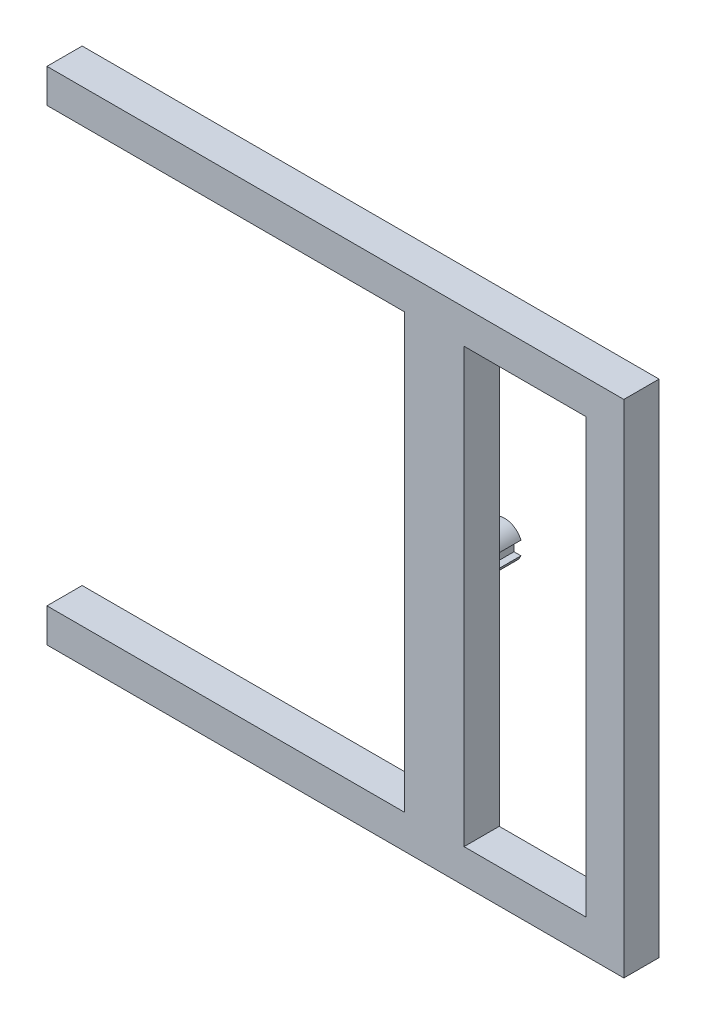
ISO-10303-21;
HEADER;
FILE_DESCRIPTION(('STEP AP214'),'2;1');
FILE_NAME('part.step','',(''),(''),'','','');
FILE_SCHEMA(('AUTOMOTIVE_DESIGN { 1 0 10303 214 1 1 1 1 }'));
ENDSEC;
DATA;
#1=APPLICATION_CONTEXT('core data for automotive mechanical design processes');
#2=APPLICATION_PROTOCOL_DEFINITION('international standard','automotive_design',2000,#1);
#3=PRODUCT_CONTEXT('',#1,'mechanical');
#4=PRODUCT('Part','Part','',(#3));
#5=PRODUCT_RELATED_PRODUCT_CATEGORY('part','',(#4));
#6=PRODUCT_DEFINITION_FORMATION('','',#4);
#7=PRODUCT_DEFINITION_CONTEXT('part definition',#1,'design');
#8=PRODUCT_DEFINITION('design','',#6,#7);
#9=PRODUCT_DEFINITION_SHAPE('','',#8);
#10=(LENGTH_UNIT() NAMED_UNIT(*) SI_UNIT(.MILLI.,.METRE.));
#11=(NAMED_UNIT(*) PLANE_ANGLE_UNIT() SI_UNIT($,.RADIAN.));
#12=(NAMED_UNIT(*) SI_UNIT($,.STERADIAN.) SOLID_ANGLE_UNIT());
#13=UNCERTAINTY_MEASURE_WITH_UNIT(LENGTH_MEASURE(1.E-05),#10,'distance_accuracy_value','');
#14=(GEOMETRIC_REPRESENTATION_CONTEXT(3) GLOBAL_UNCERTAINTY_ASSIGNED_CONTEXT((#13)) GLOBAL_UNIT_ASSIGNED_CONTEXT((#10,
#11,#12)) REPRESENTATION_CONTEXT('',''));
#15=CARTESIAN_POINT('',(0.,0.,0.));
#16=DIRECTION('',(0.,0.,1.));
#17=DIRECTION('',(1.,0.,0.));
#18=AXIS2_PLACEMENT_3D('',#15,#16,#17);
#19=CARTESIAN_POINT('',(0.,25.,0.));
#20=DIRECTION('',(0.,0.,-1.));
#21=DIRECTION('',(-1.,0.,0.));
#22=AXIS2_PLACEMENT_3D('',#19,#20,#21);
#23=PLANE('',#22);
#24=DIRECTION('',(0.,-1.,0.));
#25=VECTOR('',#24,1.);
#26=CARTESIAN_POINT('',(308.,0.,0.));
#27=LINE('',#26,#25);
#28=CARTESIAN_POINT('',(308.,0.,0.));
#29=VERTEX_POINT('',#28);
#30=CARTESIAN_POINT('',(308.,-320.,0.));
#31=VERTEX_POINT('',#30);
#32=EDGE_CURVE('E270',#29,#31,#27,.T.);
#33=ORIENTED_EDGE('',*,*,#32,.T.);
#34=DIRECTION('',(1.,0.,0.));
#35=VECTOR('',#34,1.);
#36=CARTESIAN_POINT('',(398.,-320.,0.));
#37=LINE('',#36,#35);
#38=CARTESIAN_POINT('',(398.,-320.,0.));
#39=VERTEX_POINT('',#38);
#40=EDGE_CURVE('E149',#31,#39,#37,.T.);
#41=ORIENTED_EDGE('',*,*,#40,.T.);
#42=DIRECTION('',(0.,1.,0.));
#43=VECTOR('',#42,1.);
#44=CARTESIAN_POINT('',(398.,0.,0.));
#45=LINE('',#44,#43);
#46=CARTESIAN_POINT('',(398.,0.,0.));
#47=VERTEX_POINT('',#46);
#48=EDGE_CURVE('E262',#39,#47,#45,.T.);
#49=ORIENTED_EDGE('',*,*,#48,.T.);
#50=DIRECTION('',(-1.,0.,0.));
#51=VECTOR('',#50,1.);
#52=CARTESIAN_POINT('',(308.,0.,0.));
#53=LINE('',#52,#51);
#54=EDGE_CURVE('E279',#47,#29,#53,.T.);
#55=ORIENTED_EDGE('',*,*,#54,.T.);
#56=EDGE_LOOP('',(#33,#41,#49,#55));
#57=FACE_BOUND('',#56,.T.);
#58=DIRECTION('',(0.,-1.,0.));
#59=VECTOR('',#58,1.);
#60=CARTESIAN_POINT('',(0.,0.,0.));
#61=LINE('',#60,#59);
#62=CARTESIAN_POINT('',(0.,25.,0.));
#63=VERTEX_POINT('',#62);
#64=CARTESIAN_POINT('',(0.,0.,0.));
#65=VERTEX_POINT('',#64);
#66=EDGE_CURVE('E290',#63,#65,#61,.T.);
#67=ORIENTED_EDGE('',*,*,#66,.F.);
#68=DIRECTION('',(-1.,0.,0.));
#69=VECTOR('',#68,1.);
#70=CARTESIAN_POINT('',(0.,25.,0.));
#71=LINE('',#70,#69);
#72=CARTESIAN_POINT('',(426.,25.,0.));
#73=VERTEX_POINT('',#72);
#74=EDGE_CURVE('E295',#73,#63,#71,.T.);
#75=ORIENTED_EDGE('',*,*,#74,.F.);
#76=DIRECTION('',(0.,1.,0.));
#77=VECTOR('',#76,1.);
#78=CARTESIAN_POINT('',(426.,0.,0.));
#79=LINE('',#78,#77);
#80=CARTESIAN_POINT('',(426.,-345.,0.));
#81=VERTEX_POINT('',#80);
#82=EDGE_CURVE('E323',#81,#73,#79,.T.);
#83=ORIENTED_EDGE('',*,*,#82,.F.);
#84=DIRECTION('',(1.,0.,0.));
#85=VECTOR('',#84,1.);
#86=CARTESIAN_POINT('',(426.,-345.,0.));
#87=LINE('',#86,#85);
#88=CARTESIAN_POINT('',(0.,-345.,0.));
#89=VERTEX_POINT('',#88);
#90=EDGE_CURVE('E320',#89,#81,#87,.T.);
#91=ORIENTED_EDGE('',*,*,#90,.F.);
#92=DIRECTION('',(0.,-1.,0.));
#93=VECTOR('',#92,1.);
#94=CARTESIAN_POINT('',(0.,-320.,0.));
#95=LINE('',#94,#93);
#96=CARTESIAN_POINT('',(0.,-320.,0.));
#97=VERTEX_POINT('',#96);
#98=EDGE_CURVE('E318',#97,#89,#95,.T.);
#99=ORIENTED_EDGE('',*,*,#98,.F.);
#100=DIRECTION('',(-1.,0.,0.));
#101=VECTOR('',#100,1.);
#102=CARTESIAN_POINT('',(264.,-320.,0.));
#103=LINE('',#102,#101);
#104=CARTESIAN_POINT('',(264.,-320.,0.));
#105=VERTEX_POINT('',#104);
#106=EDGE_CURVE('E316',#105,#97,#103,.T.);
#107=ORIENTED_EDGE('',*,*,#106,.F.);
#108=DIRECTION('',(0.,-1.,0.));
#109=VECTOR('',#108,1.);
#110=CARTESIAN_POINT('',(264.,0.,0.));
#111=LINE('',#110,#109);
#112=CARTESIAN_POINT('',(264.,0.,0.));
#113=VERTEX_POINT('',#112);
#114=EDGE_CURVE('E314',#113,#105,#111,.T.);
#115=ORIENTED_EDGE('',*,*,#114,.F.);
#116=DIRECTION('',(1.,0.,0.));
#117=VECTOR('',#116,1.);
#118=CARTESIAN_POINT('',(0.,0.,0.));
#119=LINE('',#118,#117);
#120=EDGE_CURVE('E312',#65,#113,#119,.T.);
#121=ORIENTED_EDGE('',*,*,#120,.F.);
#122=EDGE_LOOP('',(#67,#75,#83,#91,#99,#107,#115,#121));
#123=FACE_BOUND('',#122,.T.);
#124=DIRECTION('',(-1.,0.,0.));
#125=VECTOR('',#124,1.);
#126=CARTESIAN_POINT('',(298.,-155.,0.));
#127=LINE('',#126,#125);
#128=CARTESIAN_POINT('',(298.,-155.,0.));
#129=VERTEX_POINT('',#128);
#130=CARTESIAN_POINT('',(292.865958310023,-155.,0.));
#131=VERTEX_POINT('',#130);
#132=EDGE_CURVE('E713',#129,#131,#127,.T.);
#133=ORIENTED_EDGE('',*,*,#132,.F.);
#134=CARTESIAN_POINT('',(286.,-160.,0.));
#135=DIRECTION('',(0.,0.,-1.));
#136=DIRECTION('',(-1.,0.,0.));
#137=AXIS2_PLACEMENT_3D('',#134,#135,#136);
#138=CIRCLE('',#137,13.);
#139=CARTESIAN_POINT('',(298.,-165.,0.));
#140=VERTEX_POINT('',#139);
#141=EDGE_CURVE('E259',#140,#129,#138,.T.);
#142=ORIENTED_EDGE('',*,*,#141,.F.);
#143=DIRECTION('',(1.,0.,0.));
#144=VECTOR('',#143,1.);
#145=CARTESIAN_POINT('',(298.,-165.,0.));
#146=LINE('',#145,#144);
#147=CARTESIAN_POINT('',(292.865958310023,-165.,0.));
#148=VERTEX_POINT('',#147);
#149=EDGE_CURVE('E255',#148,#140,#146,.T.);
#150=ORIENTED_EDGE('',*,*,#149,.F.);
#151=DIRECTION('',(0.,-1.,0.));
#152=VECTOR('',#151,1.);
#153=CARTESIAN_POINT('',(292.865958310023,-155.,0.));
#154=LINE('',#153,#152);
#155=EDGE_CURVE('E715',#131,#148,#154,.T.);
#156=ORIENTED_EDGE('',*,*,#155,.F.);
#157=EDGE_LOOP('',(#133,#142,#150,#156));
#158=FACE_BOUND('',#157,.T.);
#159=ADVANCED_FACE('F33',(#57,#123,#158),#23,.T.);
#160=CARTESIAN_POINT('',(0.,25.,26.));
#161=DIRECTION('',(0.,0.,-1.));
#162=DIRECTION('',(-1.,0.,0.));
#163=AXIS2_PLACEMENT_3D('',#160,#161,#162);
#164=PLANE('',#163);
#165=DIRECTION('',(0.,-1.,0.));
#166=VECTOR('',#165,1.);
#167=CARTESIAN_POINT('',(0.,0.,26.));
#168=LINE('',#167,#166);
#169=CARTESIAN_POINT('',(0.,25.,26.));
#170=VERTEX_POINT('',#169);
#171=CARTESIAN_POINT('',(0.,0.,26.));
#172=VERTEX_POINT('',#171);
#173=EDGE_CURVE('E291',#170,#172,#168,.T.);
#174=ORIENTED_EDGE('',*,*,#173,.T.);
#175=DIRECTION('',(1.,0.,0.));
#176=VECTOR('',#175,1.);
#177=CARTESIAN_POINT('',(0.,0.,26.));
#178=LINE('',#177,#176);
#179=CARTESIAN_POINT('',(264.,0.,26.));
#180=VERTEX_POINT('',#179);
#181=EDGE_CURVE('E294',#172,#180,#178,.T.);
#182=ORIENTED_EDGE('',*,*,#181,.T.);
#183=DIRECTION('',(0.,-1.,0.));
#184=VECTOR('',#183,1.);
#185=CARTESIAN_POINT('',(264.,0.,26.));
#186=LINE('',#185,#184);
#187=CARTESIAN_POINT('',(264.,-320.,26.));
#188=VERTEX_POINT('',#187);
#189=EDGE_CURVE('E297',#180,#188,#186,.T.);
#190=ORIENTED_EDGE('',*,*,#189,.T.);
#191=DIRECTION('',(-1.,0.,0.));
#192=VECTOR('',#191,1.);
#193=CARTESIAN_POINT('',(264.,-320.,26.));
#194=LINE('',#193,#192);
#195=CARTESIAN_POINT('',(0.,-320.,26.));
#196=VERTEX_POINT('',#195);
#197=EDGE_CURVE('E299',#188,#196,#194,.T.);
#198=ORIENTED_EDGE('',*,*,#197,.T.);
#199=DIRECTION('',(0.,-1.,0.));
#200=VECTOR('',#199,1.);
#201=CARTESIAN_POINT('',(0.,-320.,26.));
#202=LINE('',#201,#200);
#203=CARTESIAN_POINT('',(0.,-345.,26.));
#204=VERTEX_POINT('',#203);
#205=EDGE_CURVE('E301',#196,#204,#202,.T.);
#206=ORIENTED_EDGE('',*,*,#205,.T.);
#207=DIRECTION('',(1.,0.,0.));
#208=VECTOR('',#207,1.);
#209=CARTESIAN_POINT('',(426.,-345.,26.));
#210=LINE('',#209,#208);
#211=CARTESIAN_POINT('',(426.,-345.,26.));
#212=VERTEX_POINT('',#211);
#213=EDGE_CURVE('E303',#204,#212,#210,.T.);
#214=ORIENTED_EDGE('',*,*,#213,.T.);
#215=DIRECTION('',(0.,1.,0.));
#216=VECTOR('',#215,1.);
#217=CARTESIAN_POINT('',(426.,-320.,26.));
#218=LINE('',#217,#216);
#219=CARTESIAN_POINT('',(426.,25.,26.));
#220=VERTEX_POINT('',#219);
#221=EDGE_CURVE('E305',#212,#220,#218,.T.);
#222=ORIENTED_EDGE('',*,*,#221,.T.);
#223=DIRECTION('',(-1.,0.,0.));
#224=VECTOR('',#223,1.);
#225=CARTESIAN_POINT('',(0.,25.,26.));
#226=LINE('',#225,#224);
#227=EDGE_CURVE('E307',#220,#170,#226,.T.);
#228=ORIENTED_EDGE('',*,*,#227,.T.);
#229=EDGE_LOOP('',(#174,#182,#190,#198,#206,#214,#222,#228));
#230=FACE_BOUND('',#229,.T.);
#231=DIRECTION('',(1.,0.,0.));
#232=VECTOR('',#231,1.);
#233=CARTESIAN_POINT('',(398.,-320.,26.));
#234=LINE('',#233,#232);
#235=CARTESIAN_POINT('',(308.,-320.,26.));
#236=VERTEX_POINT('',#235);
#237=CARTESIAN_POINT('',(398.,-320.,26.));
#238=VERTEX_POINT('',#237);
#239=EDGE_CURVE('E267',#236,#238,#234,.T.);
#240=ORIENTED_EDGE('',*,*,#239,.F.);
#241=DIRECTION('',(0.,-1.,0.));
#242=VECTOR('',#241,1.);
#243=CARTESIAN_POINT('',(308.,0.,26.));
#244=LINE('',#243,#242);
#245=CARTESIAN_POINT('',(308.,0.,26.));
#246=VERTEX_POINT('',#245);
#247=EDGE_CURVE('E274',#246,#236,#244,.T.);
#248=ORIENTED_EDGE('',*,*,#247,.F.);
#249=DIRECTION('',(-1.,0.,0.));
#250=VECTOR('',#249,1.);
#251=CARTESIAN_POINT('',(308.,0.,26.));
#252=LINE('',#251,#250);
#253=CARTESIAN_POINT('',(398.,0.,26.));
#254=VERTEX_POINT('',#253);
#255=EDGE_CURVE('E272',#254,#246,#252,.T.);
#256=ORIENTED_EDGE('',*,*,#255,.F.);
#257=DIRECTION('',(0.,1.,0.));
#258=VECTOR('',#257,1.);
#259=CARTESIAN_POINT('',(398.,0.,26.));
#260=LINE('',#259,#258);
#261=EDGE_CURVE('E269',#238,#254,#260,.T.);
#262=ORIENTED_EDGE('',*,*,#261,.F.);
#263=EDGE_LOOP('',(#240,#248,#256,#262));
#264=FACE_BOUND('',#263,.T.);
#265=ADVANCED_FACE('F586',(#230,#264),#164,.F.);
#266=CARTESIAN_POINT('',(0.,0.,26.));
#267=DIRECTION('',(1.,0.,0.));
#268=DIRECTION('',(0.,0.,-1.));
#269=AXIS2_PLACEMENT_3D('',#266,#267,#268);
#270=PLANE('',#269);
#271=ORIENTED_EDGE('',*,*,#66,.T.);
#272=DIRECTION('',(0.,0.,-1.));
#273=VECTOR('',#272,1.);
#274=CARTESIAN_POINT('',(0.,0.,26.));
#275=LINE('',#274,#273);
#276=EDGE_CURVE('E346',#172,#65,#275,.T.);
#277=ORIENTED_EDGE('',*,*,#276,.F.);
#278=ORIENTED_EDGE('',*,*,#173,.F.);
#279=DIRECTION('',(0.,0.,-1.));
#280=VECTOR('',#279,1.);
#281=CARTESIAN_POINT('',(0.,25.,26.));
#282=LINE('',#281,#280);
#283=EDGE_CURVE('E309',#170,#63,#282,.T.);
#284=ORIENTED_EDGE('',*,*,#283,.T.);
#285=EDGE_LOOP('',(#271,#277,#278,#284));
#286=FACE_BOUND('',#285,.T.);
#287=ADVANCED_FACE('F484',(#286),#270,.F.);
#288=CARTESIAN_POINT('',(0.,0.,26.));
#289=DIRECTION('',(0.,1.,0.));
#290=DIRECTION('',(-1.,0.,0.));
#291=AXIS2_PLACEMENT_3D('',#288,#289,#290);
#292=PLANE('',#291);
#293=ORIENTED_EDGE('',*,*,#120,.T.);
#294=DIRECTION('',(0.,0.,-1.));
#295=VECTOR('',#294,1.);
#296=CARTESIAN_POINT('',(264.,0.,26.));
#297=LINE('',#296,#295);
#298=EDGE_CURVE('E343',#180,#113,#297,.T.);
#299=ORIENTED_EDGE('',*,*,#298,.F.);
#300=ORIENTED_EDGE('',*,*,#181,.F.);
#301=ORIENTED_EDGE('',*,*,#276,.T.);
#302=EDGE_LOOP('',(#293,#299,#300,#301));
#303=FACE_BOUND('',#302,.T.);
#304=ADVANCED_FACE('F673',(#303),#292,.F.);
#305=CARTESIAN_POINT('',(264.,0.,26.));
#306=DIRECTION('',(1.,0.,0.));
#307=DIRECTION('',(0.,0.,-1.));
#308=AXIS2_PLACEMENT_3D('',#305,#306,#307);
#309=PLANE('',#308);
#310=ORIENTED_EDGE('',*,*,#114,.T.);
#311=DIRECTION('',(0.,0.,-1.));
#312=VECTOR('',#311,1.);
#313=CARTESIAN_POINT('',(264.,-320.,26.));
#314=LINE('',#313,#312);
#315=EDGE_CURVE('E340',#188,#105,#314,.T.);
#316=ORIENTED_EDGE('',*,*,#315,.F.);
#317=ORIENTED_EDGE('',*,*,#189,.F.);
#318=ORIENTED_EDGE('',*,*,#298,.T.);
#319=EDGE_LOOP('',(#310,#316,#317,#318));
#320=FACE_BOUND('',#319,.T.);
#321=ADVANCED_FACE('F670',(#320),#309,.F.);
#322=CARTESIAN_POINT('',(264.,-320.,26.));
#323=DIRECTION('',(0.,-1.,0.));
#324=DIRECTION('',(1.,0.,0.));
#325=AXIS2_PLACEMENT_3D('',#322,#323,#324);
#326=PLANE('',#325);
#327=ORIENTED_EDGE('',*,*,#106,.T.);
#328=DIRECTION('',(0.,0.,-1.));
#329=VECTOR('',#328,1.);
#330=CARTESIAN_POINT('',(0.,-320.,26.));
#331=LINE('',#330,#329);
#332=EDGE_CURVE('E337',#196,#97,#331,.T.);
#333=ORIENTED_EDGE('',*,*,#332,.F.);
#334=ORIENTED_EDGE('',*,*,#197,.F.);
#335=ORIENTED_EDGE('',*,*,#315,.T.);
#336=EDGE_LOOP('',(#327,#333,#334,#335));
#337=FACE_BOUND('',#336,.T.);
#338=ADVANCED_FACE('F666',(#337),#326,.F.);
#339=CARTESIAN_POINT('',(0.,-320.,26.));
#340=DIRECTION('',(1.,0.,0.));
#341=DIRECTION('',(0.,1.,0.));
#342=AXIS2_PLACEMENT_3D('',#339,#340,#341);
#343=PLANE('',#342);
#344=ORIENTED_EDGE('',*,*,#98,.T.);
#345=DIRECTION('',(0.,0.,-1.));
#346=VECTOR('',#345,1.);
#347=CARTESIAN_POINT('',(0.,-345.,26.));
#348=LINE('',#347,#346);
#349=EDGE_CURVE('E334',#204,#89,#348,.T.);
#350=ORIENTED_EDGE('',*,*,#349,.F.);
#351=ORIENTED_EDGE('',*,*,#205,.F.);
#352=ORIENTED_EDGE('',*,*,#332,.T.);
#353=EDGE_LOOP('',(#344,#350,#351,#352));
#354=FACE_BOUND('',#353,.T.);
#355=ADVANCED_FACE('F662',(#354),#343,.F.);
#356=CARTESIAN_POINT('',(426.,-345.,26.));
#357=DIRECTION('',(0.,1.,0.));
#358=DIRECTION('',(-1.,0.,0.));
#359=AXIS2_PLACEMENT_3D('',#356,#357,#358);
#360=PLANE('',#359);
#361=ORIENTED_EDGE('',*,*,#90,.T.);
#362=DIRECTION('',(0.,0.,-1.));
#363=VECTOR('',#362,1.);
#364=CARTESIAN_POINT('',(426.,-345.,26.));
#365=LINE('',#364,#363);
#366=EDGE_CURVE('E331',#212,#81,#365,.T.);
#367=ORIENTED_EDGE('',*,*,#366,.F.);
#368=ORIENTED_EDGE('',*,*,#213,.F.);
#369=ORIENTED_EDGE('',*,*,#349,.T.);
#370=EDGE_LOOP('',(#361,#367,#368,#369));
#371=FACE_BOUND('',#370,.T.);
#372=ADVANCED_FACE('F658',(#371),#360,.F.);
#373=CARTESIAN_POINT('',(426.,0.,26.));
#374=DIRECTION('',(-1.,0.,0.));
#375=DIRECTION('',(0.,-1.,0.));
#376=AXIS2_PLACEMENT_3D('',#373,#374,#375);
#377=PLANE('',#376);
#378=ORIENTED_EDGE('',*,*,#82,.T.);
#379=DIRECTION('',(0.,0.,-1.));
#380=VECTOR('',#379,1.);
#381=CARTESIAN_POINT('',(426.,25.,26.));
#382=LINE('',#381,#380);
#383=EDGE_CURVE('E328',#220,#73,#382,.T.);
#384=ORIENTED_EDGE('',*,*,#383,.F.);
#385=ORIENTED_EDGE('',*,*,#221,.F.);
#386=ORIENTED_EDGE('',*,*,#366,.T.);
#387=EDGE_LOOP('',(#378,#384,#385,#386));
#388=FACE_BOUND('',#387,.T.);
#389=ADVANCED_FACE('F654',(#388),#377,.F.);
#390=CARTESIAN_POINT('',(0.,25.,26.));
#391=DIRECTION('',(0.,-1.,0.));
#392=DIRECTION('',(0.,0.,-1.));
#393=AXIS2_PLACEMENT_3D('',#390,#391,#392);
#394=PLANE('',#393);
#395=ORIENTED_EDGE('',*,*,#74,.T.);
#396=ORIENTED_EDGE('',*,*,#283,.F.);
#397=ORIENTED_EDGE('',*,*,#227,.F.);
#398=ORIENTED_EDGE('',*,*,#383,.T.);
#399=EDGE_LOOP('',(#395,#396,#397,#398));
#400=FACE_BOUND('',#399,.T.);
#401=ADVANCED_FACE('F649',(#400),#394,.F.);
#402=CARTESIAN_POINT('',(398.,-320.,26.));
#403=DIRECTION('',(0.,1.,0.));
#404=DIRECTION('',(0.,0.,1.));
#405=AXIS2_PLACEMENT_3D('',#402,#403,#404);
#406=PLANE('',#405);
#407=ORIENTED_EDGE('',*,*,#40,.F.);
#408=DIRECTION('',(0.,0.,-1.));
#409=VECTOR('',#408,1.);
#410=CARTESIAN_POINT('',(308.,-320.,26.));
#411=LINE('',#410,#409);
#412=EDGE_CURVE('E275',#236,#31,#411,.T.);
#413=ORIENTED_EDGE('',*,*,#412,.F.);
#414=ORIENTED_EDGE('',*,*,#239,.T.);
#415=DIRECTION('',(0.,0.,-1.));
#416=VECTOR('',#415,1.);
#417=CARTESIAN_POINT('',(398.,-320.,26.));
#418=LINE('',#417,#416);
#419=EDGE_CURVE('E288',#238,#39,#418,.T.);
#420=ORIENTED_EDGE('',*,*,#419,.T.);
#421=EDGE_LOOP('',(#407,#413,#414,#420));
#422=FACE_BOUND('',#421,.T.);
#423=ADVANCED_FACE('F645',(#422),#406,.T.);
#424=CARTESIAN_POINT('',(398.,0.,26.));
#425=DIRECTION('',(-1.,0.,0.));
#426=DIRECTION('',(0.,-1.,0.));
#427=AXIS2_PLACEMENT_3D('',#424,#425,#426);
#428=PLANE('',#427);
#429=ORIENTED_EDGE('',*,*,#48,.F.);
#430=ORIENTED_EDGE('',*,*,#419,.F.);
#431=ORIENTED_EDGE('',*,*,#261,.T.);
#432=DIRECTION('',(0.,0.,-1.));
#433=VECTOR('',#432,1.);
#434=CARTESIAN_POINT('',(398.,0.,26.));
#435=LINE('',#434,#433);
#436=EDGE_CURVE('E286',#254,#47,#435,.T.);
#437=ORIENTED_EDGE('',*,*,#436,.T.);
#438=EDGE_LOOP('',(#429,#430,#431,#437));
#439=FACE_BOUND('',#438,.T.);
#440=ADVANCED_FACE('F641',(#439),#428,.T.);
#441=CARTESIAN_POINT('',(308.,0.,26.));
#442=DIRECTION('',(0.,-1.,0.));
#443=DIRECTION('',(1.,0.,0.));
#444=AXIS2_PLACEMENT_3D('',#441,#442,#443);
#445=PLANE('',#444);
#446=ORIENTED_EDGE('',*,*,#54,.F.);
#447=ORIENTED_EDGE('',*,*,#436,.F.);
#448=ORIENTED_EDGE('',*,*,#255,.T.);
#449=DIRECTION('',(0.,0.,-1.));
#450=VECTOR('',#449,1.);
#451=CARTESIAN_POINT('',(308.,0.,26.));
#452=LINE('',#451,#450);
#453=EDGE_CURVE('E141',#246,#29,#452,.T.);
#454=ORIENTED_EDGE('',*,*,#453,.T.);
#455=EDGE_LOOP('',(#446,#447,#448,#454));
#456=FACE_BOUND('',#455,.T.);
#457=ADVANCED_FACE('F638',(#456),#445,.T.);
#458=CARTESIAN_POINT('',(308.,0.,26.));
#459=DIRECTION('',(1.,0.,0.));
#460=DIRECTION('',(0.,0.,-1.));
#461=AXIS2_PLACEMENT_3D('',#458,#459,#460);
#462=PLANE('',#461);
#463=ORIENTED_EDGE('',*,*,#32,.F.);
#464=ORIENTED_EDGE('',*,*,#453,.F.);
#465=ORIENTED_EDGE('',*,*,#247,.T.);
#466=ORIENTED_EDGE('',*,*,#412,.T.);
#467=EDGE_LOOP('',(#463,#464,#465,#466));
#468=FACE_BOUND('',#467,.T.);
#469=ADVANCED_FACE('F597',(#468),#462,.T.);
#470=CARTESIAN_POINT('',(286.,-160.,-26.));
#471=DIRECTION('',(0.,0.,1.));
#472=DIRECTION('',(1.,0.,0.));
#473=AXIS2_PLACEMENT_3D('',#470,#471,#472);
#474=CYLINDRICAL_SURFACE('',#473,13.);
#475=ORIENTED_EDGE('',*,*,#141,.T.);
#476=DIRECTION('',(0.,0.,1.));
#477=VECTOR('',#476,1.);
#478=CARTESIAN_POINT('',(298.,-155.,-26.));
#479=LINE('',#478,#477);
#480=CARTESIAN_POINT('',(298.,-155.,-26.));
#481=VERTEX_POINT('',#480);
#482=EDGE_CURVE('E240',#481,#129,#479,.T.);
#483=ORIENTED_EDGE('',*,*,#482,.F.);
#484=CARTESIAN_POINT('',(286.,-160.,-26.));
#485=DIRECTION('',(0.,0.,-1.));
#486=DIRECTION('',(-1.,0.,0.));
#487=AXIS2_PLACEMENT_3D('',#484,#485,#486);
#488=CIRCLE('',#487,13.);
#489=CARTESIAN_POINT('',(298.,-165.,-26.));
#490=VERTEX_POINT('',#489);
#491=EDGE_CURVE('E247',#490,#481,#488,.T.);
#492=ORIENTED_EDGE('',*,*,#491,.F.);
#493=DIRECTION('',(0.,0.,1.));
#494=VECTOR('',#493,1.);
#495=CARTESIAN_POINT('',(298.,-165.,-26.));
#496=LINE('',#495,#494);
#497=EDGE_CURVE('E722',#490,#140,#496,.T.);
#498=ORIENTED_EDGE('',*,*,#497,.T.);
#499=EDGE_LOOP('',(#475,#483,#492,#498));
#500=FACE_BOUND('',#499,.T.);
#501=ADVANCED_FACE('F257',(#500),#474,.T.);
#502=CARTESIAN_POINT('',(298.,-155.,-26.));
#503=DIRECTION('',(0.,1.,0.));
#504=DIRECTION('',(0.,0.,1.));
#505=AXIS2_PLACEMENT_3D('',#502,#503,#504);
#506=PLANE('',#505);
#507=ORIENTED_EDGE('',*,*,#132,.T.);
#508=DIRECTION('',(0.,0.,1.));
#509=VECTOR('',#508,1.);
#510=CARTESIAN_POINT('',(292.865958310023,-155.,-26.));
#511=LINE('',#510,#509);
#512=CARTESIAN_POINT('',(292.865958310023,-155.,-26.));
#513=VERTEX_POINT('',#512);
#514=EDGE_CURVE('E243',#513,#131,#511,.T.);
#515=ORIENTED_EDGE('',*,*,#514,.F.);
#516=DIRECTION('',(-1.,0.,0.));
#517=VECTOR('',#516,1.);
#518=CARTESIAN_POINT('',(298.,-155.,-26.));
#519=LINE('',#518,#517);
#520=EDGE_CURVE('E236',#481,#513,#519,.T.);
#521=ORIENTED_EDGE('',*,*,#520,.F.);
#522=ORIENTED_EDGE('',*,*,#482,.T.);
#523=EDGE_LOOP('',(#507,#515,#521,#522));
#524=FACE_BOUND('',#523,.T.);
#525=ADVANCED_FACE('F238',(#524),#506,.F.);
#526=CARTESIAN_POINT('',(292.865958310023,-155.,-26.));
#527=DIRECTION('',(-1.,0.,0.));
#528=DIRECTION('',(0.,0.,1.));
#529=AXIS2_PLACEMENT_3D('',#526,#527,#528);
#530=PLANE('',#529);
#531=ORIENTED_EDGE('',*,*,#155,.T.);
#532=DIRECTION('',(0.,0.,1.));
#533=VECTOR('',#532,1.);
#534=CARTESIAN_POINT('',(292.865958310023,-165.,-26.));
#535=LINE('',#534,#533);
#536=CARTESIAN_POINT('',(292.865958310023,-165.,-26.));
#537=VERTEX_POINT('',#536);
#538=EDGE_CURVE('E51',#537,#148,#535,.T.);
#539=ORIENTED_EDGE('',*,*,#538,.F.);
#540=DIRECTION('',(0.,-1.,0.));
#541=VECTOR('',#540,1.);
#542=CARTESIAN_POINT('',(292.865958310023,-155.,-26.));
#543=LINE('',#542,#541);
#544=EDGE_CURVE('E246',#513,#537,#543,.T.);
#545=ORIENTED_EDGE('',*,*,#544,.F.);
#546=ORIENTED_EDGE('',*,*,#514,.T.);
#547=EDGE_LOOP('',(#531,#539,#545,#546));
#548=FACE_BOUND('',#547,.T.);
#549=ADVANCED_FACE('F607',(#548),#530,.F.);
#550=CARTESIAN_POINT('',(298.,-165.,-26.));
#551=DIRECTION('',(0.,-1.,0.));
#552=DIRECTION('',(0.,0.,-1.));
#553=AXIS2_PLACEMENT_3D('',#550,#551,#552);
#554=PLANE('',#553);
#555=ORIENTED_EDGE('',*,*,#149,.T.);
#556=ORIENTED_EDGE('',*,*,#497,.F.);
#557=DIRECTION('',(1.,0.,0.));
#558=VECTOR('',#557,1.);
#559=CARTESIAN_POINT('',(298.,-165.,-26.));
#560=LINE('',#559,#558);
#561=EDGE_CURVE('E251',#537,#490,#560,.T.);
#562=ORIENTED_EDGE('',*,*,#561,.F.);
#563=ORIENTED_EDGE('',*,*,#538,.T.);
#564=EDGE_LOOP('',(#555,#556,#562,#563));
#565=FACE_BOUND('',#564,.T.);
#566=ADVANCED_FACE('F616',(#565),#554,.F.);
#567=CARTESIAN_POINT('',(286.,-160.,-26.));
#568=DIRECTION('',(0.,0.,-1.));
#569=DIRECTION('',(-1.,0.,0.));
#570=AXIS2_PLACEMENT_3D('',#567,#568,#569);
#571=PLANE('',#570);
#572=ORIENTED_EDGE('',*,*,#491,.T.);
#573=ORIENTED_EDGE('',*,*,#520,.T.);
#574=ORIENTED_EDGE('',*,*,#544,.T.);
#575=ORIENTED_EDGE('',*,*,#561,.T.);
#576=EDGE_LOOP('',(#572,#573,#574,#575));
#577=FACE_BOUND('',#576,.T.);
#578=ADVANCED_FACE('F250',(#577),#571,.T.);
#579=CLOSED_SHELL('',(#159,#265,#287,#304,#321,#338,#355,#372,#389,#401,#423,#440,#457,#469,
#501,#525,#549,#566,#578));
#580=CARTESIAN_POINT('',(0.,25.,24.));
#581=DIRECTION('',(0.,0.,-1.));
#582=DIRECTION('',(-1.,0.,0.));
#583=AXIS2_PLACEMENT_3D('',#580,#581,#582);
#584=PLANE('',#583);
#585=DIRECTION('',(0.,-1.,0.));
#586=VECTOR('',#585,1.);
#587=CARTESIAN_POINT('',(2.,25.,24.));
#588=LINE('',#587,#586);
#589=CARTESIAN_POINT('',(2.,23.,24.));
#590=VERTEX_POINT('',#589);
#591=CARTESIAN_POINT('',(2.,2.,24.));
#592=VERTEX_POINT('',#591);
#593=EDGE_CURVE('E37',#590,#592,#588,.T.);
#594=ORIENTED_EDGE('',*,*,#593,.F.);
#595=DIRECTION('',(-1.,0.,0.));
#596=VECTOR('',#595,1.);
#597=CARTESIAN_POINT('',(0.,23.,24.));
#598=LINE('',#597,#596);
#599=CARTESIAN_POINT('',(424.,23.,24.));
#600=VERTEX_POINT('',#599);
#601=EDGE_CURVE('E416',#600,#590,#598,.T.);
#602=ORIENTED_EDGE('',*,*,#601,.F.);
#603=DIRECTION('',(0.,1.,0.));
#604=VECTOR('',#603,1.);
#605=CARTESIAN_POINT('',(424.,24.9999999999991,24.));
#606=LINE('',#605,#604);
#607=CARTESIAN_POINT('',(423.999999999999,-343.,24.));
#608=VERTEX_POINT('',#607);
#609=EDGE_CURVE('E418',#608,#600,#606,.T.);
#610=ORIENTED_EDGE('',*,*,#609,.F.);
#611=DIRECTION('',(1.,0.,0.));
#612=VECTOR('',#611,1.);
#613=CARTESIAN_POINT('',(0.,-343.,24.));
#614=LINE('',#613,#612);
#615=CARTESIAN_POINT('',(2.00000000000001,-343.,24.));
#616=VERTEX_POINT('',#615);
#617=EDGE_CURVE('E420',#616,#608,#614,.T.);
#618=ORIENTED_EDGE('',*,*,#617,.F.);
#619=DIRECTION('',(0.,-1.,0.));
#620=VECTOR('',#619,1.);
#621=CARTESIAN_POINT('',(1.99999999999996,25.,24.));
#622=LINE('',#621,#620);
#623=CARTESIAN_POINT('',(2.,-322.,24.));
#624=VERTEX_POINT('',#623);
#625=EDGE_CURVE('E422',#624,#616,#622,.T.);
#626=ORIENTED_EDGE('',*,*,#625,.F.);
#627=DIRECTION('',(-1.,0.,0.));
#628=VECTOR('',#627,1.);
#629=CARTESIAN_POINT('',(0.,-322.,24.));
#630=LINE('',#629,#628);
#631=CARTESIAN_POINT('',(266.,-322.,24.));
#632=VERTEX_POINT('',#631);
#633=EDGE_CURVE('E424',#632,#624,#630,.T.);
#634=ORIENTED_EDGE('',*,*,#633,.F.);
#635=DIRECTION('',(0.,-1.,0.));
#636=VECTOR('',#635,1.);
#637=CARTESIAN_POINT('',(266.,25.,24.));
#638=LINE('',#637,#636);
#639=CARTESIAN_POINT('',(266.,2.00000000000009,24.));
#640=VERTEX_POINT('',#639);
#641=EDGE_CURVE('E426',#640,#632,#638,.T.);
#642=ORIENTED_EDGE('',*,*,#641,.F.);
#643=DIRECTION('',(1.,0.,0.));
#644=VECTOR('',#643,1.);
#645=CARTESIAN_POINT('',(0.,2.,24.));
#646=LINE('',#645,#644);
#647=EDGE_CURVE('E133',#592,#640,#646,.T.);
#648=ORIENTED_EDGE('',*,*,#647,.F.);
#649=EDGE_LOOP('',(#594,#602,#610,#618,#626,#634,#642,#648));
#650=FACE_BOUND('',#649,.T.);
#651=DIRECTION('',(1.,0.,0.));
#652=VECTOR('',#651,1.);
#653=CARTESIAN_POINT('',(0.,-322.,24.));
#654=LINE('',#653,#652);
#655=CARTESIAN_POINT('',(306.,-322.,24.));
#656=VERTEX_POINT('',#655);
#657=CARTESIAN_POINT('',(400.,-322.,24.));
#658=VERTEX_POINT('',#657);
#659=EDGE_CURVE('E361',#656,#658,#654,.T.);
#660=ORIENTED_EDGE('',*,*,#659,.T.);
#661=DIRECTION('',(0.,1.,0.));
#662=VECTOR('',#661,1.);
#663=CARTESIAN_POINT('',(400.,25.0000000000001,24.));
#664=LINE('',#663,#662);
#665=CARTESIAN_POINT('',(400.,1.99999999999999,24.));
#666=VERTEX_POINT('',#665);
#667=EDGE_CURVE('E356',#658,#666,#664,.T.);
#668=ORIENTED_EDGE('',*,*,#667,.T.);
#669=DIRECTION('',(-1.,0.,0.));
#670=VECTOR('',#669,1.);
#671=CARTESIAN_POINT('',(0.,2.00000000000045,24.));
#672=LINE('',#671,#670);
#673=CARTESIAN_POINT('',(306.,2.0000000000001,24.));
#674=VERTEX_POINT('',#673);
#675=EDGE_CURVE('E352',#666,#674,#672,.T.);
#676=ORIENTED_EDGE('',*,*,#675,.T.);
#677=DIRECTION('',(0.,-1.,0.));
#678=VECTOR('',#677,1.);
#679=CARTESIAN_POINT('',(306.,25.,24.));
#680=LINE('',#679,#678);
#681=EDGE_CURVE('E43',#674,#656,#680,.T.);
#682=ORIENTED_EDGE('',*,*,#681,.T.);
#683=EDGE_LOOP('',(#660,#668,#676,#682));
#684=FACE_BOUND('',#683,.T.);
#685=ADVANCED_FACE('F445',(#650,#684),#584,.T.);
#686=CARTESIAN_POINT('',(0.,25.,2.));
#687=DIRECTION('',(0.,0.,-1.));
#688=DIRECTION('',(-1.,0.,0.));
#689=AXIS2_PLACEMENT_3D('',#686,#687,#688);
#690=PLANE('',#689);
#691=DIRECTION('',(0.,-1.,0.));
#692=VECTOR('',#691,1.);
#693=CARTESIAN_POINT('',(2.,25.,2.));
#694=LINE('',#693,#692);
#695=CARTESIAN_POINT('',(2.,23.,2.));
#696=VERTEX_POINT('',#695);
#697=CARTESIAN_POINT('',(2.,2.,2.));
#698=VERTEX_POINT('',#697);
#699=EDGE_CURVE('E401',#696,#698,#694,.T.);
#700=ORIENTED_EDGE('',*,*,#699,.T.);
#701=DIRECTION('',(1.,0.,0.));
#702=VECTOR('',#701,1.);
#703=CARTESIAN_POINT('',(0.,2.,2.));
#704=LINE('',#703,#702);
#705=CARTESIAN_POINT('',(266.,2.00000000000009,2.));
#706=VERTEX_POINT('',#705);
#707=EDGE_CURVE('E396',#698,#706,#704,.T.);
#708=ORIENTED_EDGE('',*,*,#707,.T.);
#709=DIRECTION('',(0.,-1.,0.));
#710=VECTOR('',#709,1.);
#711=CARTESIAN_POINT('',(266.,25.,2.));
#712=LINE('',#711,#710);
#713=CARTESIAN_POINT('',(266.,-322.,2.));
#714=VERTEX_POINT('',#713);
#715=EDGE_CURVE('E391',#706,#714,#712,.T.);
#716=ORIENTED_EDGE('',*,*,#715,.T.);
#717=DIRECTION('',(-1.,0.,0.));
#718=VECTOR('',#717,1.);
#719=CARTESIAN_POINT('',(0.,-322.,2.));
#720=LINE('',#719,#718);
#721=CARTESIAN_POINT('',(2.,-322.,2.));
#722=VERTEX_POINT('',#721);
#723=EDGE_CURVE('E387',#714,#722,#720,.T.);
#724=ORIENTED_EDGE('',*,*,#723,.T.);
#725=DIRECTION('',(0.,-1.,0.));
#726=VECTOR('',#725,1.);
#727=CARTESIAN_POINT('',(1.99999999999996,25.,2.));
#728=LINE('',#727,#726);
#729=CARTESIAN_POINT('',(2.00000000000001,-343.,2.));
#730=VERTEX_POINT('',#729);
#731=EDGE_CURVE('E382',#722,#730,#728,.T.);
#732=ORIENTED_EDGE('',*,*,#731,.T.);
#733=DIRECTION('',(1.,0.,0.));
#734=VECTOR('',#733,1.);
#735=CARTESIAN_POINT('',(0.,-343.,2.));
#736=LINE('',#735,#734);
#737=CARTESIAN_POINT('',(423.999999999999,-343.,2.));
#738=VERTEX_POINT('',#737);
#739=EDGE_CURVE('E376',#730,#738,#736,.T.);
#740=ORIENTED_EDGE('',*,*,#739,.T.);
#741=DIRECTION('',(0.,1.,0.));
#742=VECTOR('',#741,1.);
#743=CARTESIAN_POINT('',(424.,24.9999999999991,2.));
#744=LINE('',#743,#742);
#745=CARTESIAN_POINT('',(424.,23.,2.));
#746=VERTEX_POINT('',#745);
#747=EDGE_CURVE('E371',#738,#746,#744,.T.);
#748=ORIENTED_EDGE('',*,*,#747,.T.);
#749=DIRECTION('',(-1.,0.,0.));
#750=VECTOR('',#749,1.);
#751=CARTESIAN_POINT('',(0.,23.,2.));
#752=LINE('',#751,#750);
#753=EDGE_CURVE('E366',#746,#696,#752,.T.);
#754=ORIENTED_EDGE('',*,*,#753,.T.);
#755=EDGE_LOOP('',(#700,#708,#716,#724,#732,#740,#748,#754));
#756=FACE_BOUND('',#755,.T.);
#757=DIRECTION('',(0.,-1.,0.));
#758=VECTOR('',#757,1.);
#759=CARTESIAN_POINT('',(306.,25.,2.));
#760=LINE('',#759,#758);
#761=CARTESIAN_POINT('',(306.,2.0000000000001,2.));
#762=VERTEX_POINT('',#761);
#763=CARTESIAN_POINT('',(306.,-322.,2.));
#764=VERTEX_POINT('',#763);
#765=EDGE_CURVE('E413',#762,#764,#760,.T.);
#766=ORIENTED_EDGE('',*,*,#765,.F.);
#767=DIRECTION('',(-1.,0.,0.));
#768=VECTOR('',#767,1.);
#769=CARTESIAN_POINT('',(0.,2.00000000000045,2.));
#770=LINE('',#769,#768);
#771=CARTESIAN_POINT('',(400.,1.99999999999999,2.));
#772=VERTEX_POINT('',#771);
#773=EDGE_CURVE('E404',#772,#762,#770,.T.);
#774=ORIENTED_EDGE('',*,*,#773,.F.);
#775=DIRECTION('',(0.,1.,0.));
#776=VECTOR('',#775,1.);
#777=CARTESIAN_POINT('',(400.,25.0000000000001,2.));
#778=LINE('',#777,#776);
#779=CARTESIAN_POINT('',(400.,-322.,2.));
#780=VERTEX_POINT('',#779);
#781=EDGE_CURVE('E407',#780,#772,#778,.T.);
#782=ORIENTED_EDGE('',*,*,#781,.F.);
#783=DIRECTION('',(1.,0.,0.));
#784=VECTOR('',#783,1.);
#785=CARTESIAN_POINT('',(0.,-322.,2.));
#786=LINE('',#785,#784);
#787=EDGE_CURVE('E410',#764,#780,#786,.T.);
#788=ORIENTED_EDGE('',*,*,#787,.F.);
#789=EDGE_LOOP('',(#766,#774,#782,#788));
#790=FACE_BOUND('',#789,.T.);
#791=ADVANCED_FACE('F438',(#756,#790),#690,.F.);
#792=CARTESIAN_POINT('',(2.,0.,26.));
#793=DIRECTION('',(1.,0.,0.));
#794=DIRECTION('',(0.,0.,-1.));
#795=AXIS2_PLACEMENT_3D('',#792,#793,#794);
#796=PLANE('',#795);
#797=ORIENTED_EDGE('',*,*,#699,.F.);
#798=DIRECTION('',(0.,0.,-1.));
#799=VECTOR('',#798,1.);
#800=CARTESIAN_POINT('',(2.,23.,26.));
#801=LINE('',#800,#799);
#802=EDGE_CURVE('E398',#590,#696,#801,.T.);
#803=ORIENTED_EDGE('',*,*,#802,.F.);
#804=ORIENTED_EDGE('',*,*,#593,.T.);
#805=DIRECTION('',(0.,0.,-1.));
#806=VECTOR('',#805,1.);
#807=CARTESIAN_POINT('',(2.,2.,26.));
#808=LINE('',#807,#806);
#809=EDGE_CURVE('E393',#592,#698,#808,.T.);
#810=ORIENTED_EDGE('',*,*,#809,.T.);
#811=EDGE_LOOP('',(#797,#803,#804,#810));
#812=FACE_BOUND('',#811,.T.);
#813=ADVANCED_FACE('F432',(#812),#796,.T.);
#814=CARTESIAN_POINT('',(0.,2.,26.));
#815=DIRECTION('',(0.,1.,0.));
#816=DIRECTION('',(-1.,0.,0.));
#817=AXIS2_PLACEMENT_3D('',#814,#815,#816);
#818=PLANE('',#817);
#819=ORIENTED_EDGE('',*,*,#707,.F.);
#820=ORIENTED_EDGE('',*,*,#809,.F.);
#821=ORIENTED_EDGE('',*,*,#647,.T.);
#822=DIRECTION('',(0.,0.,-1.));
#823=VECTOR('',#822,1.);
#824=CARTESIAN_POINT('',(266.,2.00000000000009,26.));
#825=LINE('',#824,#823);
#826=EDGE_CURVE('E389',#640,#706,#825,.T.);
#827=ORIENTED_EDGE('',*,*,#826,.T.);
#828=EDGE_LOOP('',(#819,#820,#821,#827));
#829=FACE_BOUND('',#828,.T.);
#830=ADVANCED_FACE('F435',(#829),#818,.T.);
#831=CARTESIAN_POINT('',(266.,0.,26.));
#832=DIRECTION('',(1.,0.,0.));
#833=DIRECTION('',(0.,0.,-1.));
#834=AXIS2_PLACEMENT_3D('',#831,#832,#833);
#835=PLANE('',#834);
#836=ORIENTED_EDGE('',*,*,#715,.F.);
#837=ORIENTED_EDGE('',*,*,#826,.F.);
#838=ORIENTED_EDGE('',*,*,#641,.T.);
#839=DIRECTION('',(0.,0.,-1.));
#840=VECTOR('',#839,1.);
#841=CARTESIAN_POINT('',(266.,-322.,26.));
#842=LINE('',#841,#840);
#843=EDGE_CURVE('E384',#632,#714,#842,.T.);
#844=ORIENTED_EDGE('',*,*,#843,.T.);
#845=EDGE_LOOP('',(#836,#837,#838,#844));
#846=FACE_BOUND('',#845,.T.);
#847=ADVANCED_FACE('F466',(#846),#835,.T.);
#848=CARTESIAN_POINT('',(264.,-322.,26.));
#849=DIRECTION('',(0.,-1.,0.));
#850=DIRECTION('',(1.,0.,0.));
#851=AXIS2_PLACEMENT_3D('',#848,#849,#850);
#852=PLANE('',#851);
#853=ORIENTED_EDGE('',*,*,#723,.F.);
#854=ORIENTED_EDGE('',*,*,#843,.F.);
#855=ORIENTED_EDGE('',*,*,#633,.T.);
#856=DIRECTION('',(0.,0.,-1.));
#857=VECTOR('',#856,1.);
#858=CARTESIAN_POINT('',(2.,-322.,26.));
#859=LINE('',#858,#857);
#860=EDGE_CURVE('E379',#624,#722,#859,.T.);
#861=ORIENTED_EDGE('',*,*,#860,.T.);
#862=EDGE_LOOP('',(#853,#854,#855,#861));
#863=FACE_BOUND('',#862,.T.);
#864=ADVANCED_FACE('F464',(#863),#852,.T.);
#865=CARTESIAN_POINT('',(2.,-320.,26.));
#866=DIRECTION('',(1.,0.,0.));
#867=DIRECTION('',(0.,1.,0.));
#868=AXIS2_PLACEMENT_3D('',#865,#866,#867);
#869=PLANE('',#868);
#870=ORIENTED_EDGE('',*,*,#731,.F.);
#871=ORIENTED_EDGE('',*,*,#860,.F.);
#872=ORIENTED_EDGE('',*,*,#625,.T.);
#873=DIRECTION('',(0.,0.,-1.));
#874=VECTOR('',#873,1.);
#875=CARTESIAN_POINT('',(2.,-343.,26.));
#876=LINE('',#875,#874);
#877=EDGE_CURVE('E373',#616,#730,#876,.T.);
#878=ORIENTED_EDGE('',*,*,#877,.T.);
#879=EDGE_LOOP('',(#870,#871,#872,#878));
#880=FACE_BOUND('',#879,.T.);
#881=ADVANCED_FACE('F457',(#880),#869,.T.);
#882=CARTESIAN_POINT('',(426.,-343.,26.));
#883=DIRECTION('',(0.,1.,0.));
#884=DIRECTION('',(-1.,0.,0.));
#885=AXIS2_PLACEMENT_3D('',#882,#883,#884);
#886=PLANE('',#885);
#887=ORIENTED_EDGE('',*,*,#739,.F.);
#888=ORIENTED_EDGE('',*,*,#877,.F.);
#889=ORIENTED_EDGE('',*,*,#617,.T.);
#890=DIRECTION('',(0.,0.,-1.));
#891=VECTOR('',#890,1.);
#892=CARTESIAN_POINT('',(423.999999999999,-343.,26.));
#893=LINE('',#892,#891);
#894=EDGE_CURVE('E368',#608,#738,#893,.T.);
#895=ORIENTED_EDGE('',*,*,#894,.T.);
#896=EDGE_LOOP('',(#887,#888,#889,#895));
#897=FACE_BOUND('',#896,.T.);
#898=ADVANCED_FACE('F453',(#897),#886,.T.);
#899=CARTESIAN_POINT('',(424.,0.,26.));
#900=DIRECTION('',(-1.,0.,0.));
#901=DIRECTION('',(0.,-1.,0.));
#902=AXIS2_PLACEMENT_3D('',#899,#900,#901);
#903=PLANE('',#902);
#904=ORIENTED_EDGE('',*,*,#747,.F.);
#905=ORIENTED_EDGE('',*,*,#894,.F.);
#906=ORIENTED_EDGE('',*,*,#609,.T.);
#907=DIRECTION('',(0.,0.,-1.));
#908=VECTOR('',#907,1.);
#909=CARTESIAN_POINT('',(424.,23.,26.));
#910=LINE('',#909,#908);
#911=EDGE_CURVE('E363',#600,#746,#910,.T.);
#912=ORIENTED_EDGE('',*,*,#911,.T.);
#913=EDGE_LOOP('',(#904,#905,#906,#912));
#914=FACE_BOUND('',#913,.T.);
#915=ADVANCED_FACE('F450',(#914),#903,.T.);
#916=CARTESIAN_POINT('',(0.,23.,26.));
#917=DIRECTION('',(0.,-1.,0.));
#918=DIRECTION('',(0.,0.,-1.));
#919=AXIS2_PLACEMENT_3D('',#916,#917,#918);
#920=PLANE('',#919);
#921=ORIENTED_EDGE('',*,*,#753,.F.);
#922=ORIENTED_EDGE('',*,*,#911,.F.);
#923=ORIENTED_EDGE('',*,*,#601,.T.);
#924=ORIENTED_EDGE('',*,*,#802,.T.);
#925=EDGE_LOOP('',(#921,#922,#923,#924));
#926=FACE_BOUND('',#925,.T.);
#927=ADVANCED_FACE('F443',(#926),#920,.T.);
#928=CARTESIAN_POINT('',(398.,-322.,26.));
#929=DIRECTION('',(0.,1.,0.));
#930=DIRECTION('',(0.,0.,1.));
#931=AXIS2_PLACEMENT_3D('',#928,#929,#930);
#932=PLANE('',#931);
#933=ORIENTED_EDGE('',*,*,#787,.T.);
#934=DIRECTION('',(0.,0.,-1.));
#935=VECTOR('',#934,1.);
#936=CARTESIAN_POINT('',(400.,-322.,26.));
#937=LINE('',#936,#935);
#938=EDGE_CURVE('E358',#658,#780,#937,.T.);
#939=ORIENTED_EDGE('',*,*,#938,.F.);
#940=ORIENTED_EDGE('',*,*,#659,.F.);
#941=DIRECTION('',(0.,0.,-1.));
#942=VECTOR('',#941,1.);
#943=CARTESIAN_POINT('',(306.,-322.,26.));
#944=LINE('',#943,#942);
#945=EDGE_CURVE('E11',#656,#764,#944,.T.);
#946=ORIENTED_EDGE('',*,*,#945,.T.);
#947=EDGE_LOOP('',(#933,#939,#940,#946));
#948=FACE_BOUND('',#947,.T.);
#949=ADVANCED_FACE('F541',(#948),#932,.F.);
#950=CARTESIAN_POINT('',(400.,0.,26.));
#951=DIRECTION('',(-1.,0.,0.));
#952=DIRECTION('',(0.,-1.,0.));
#953=AXIS2_PLACEMENT_3D('',#950,#951,#952);
#954=PLANE('',#953);
#955=ORIENTED_EDGE('',*,*,#781,.T.);
#956=DIRECTION('',(0.,0.,-1.));
#957=VECTOR('',#956,1.);
#958=CARTESIAN_POINT('',(400.,1.99999999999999,26.));
#959=LINE('',#958,#957);
#960=EDGE_CURVE('E354',#666,#772,#959,.T.);
#961=ORIENTED_EDGE('',*,*,#960,.F.);
#962=ORIENTED_EDGE('',*,*,#667,.F.);
#963=ORIENTED_EDGE('',*,*,#938,.T.);
#964=EDGE_LOOP('',(#955,#961,#962,#963));
#965=FACE_BOUND('',#964,.T.);
#966=ADVANCED_FACE('F550',(#965),#954,.F.);
#967=CARTESIAN_POINT('',(308.,2.0000000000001,26.));
#968=DIRECTION('',(0.,-1.,0.));
#969=DIRECTION('',(1.,0.,0.));
#970=AXIS2_PLACEMENT_3D('',#967,#968,#969);
#971=PLANE('',#970);
#972=ORIENTED_EDGE('',*,*,#773,.T.);
#973=DIRECTION('',(0.,0.,-1.));
#974=VECTOR('',#973,1.);
#975=CARTESIAN_POINT('',(306.,2.0000000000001,26.));
#976=LINE('',#975,#974);
#977=EDGE_CURVE('E350',#674,#762,#976,.T.);
#978=ORIENTED_EDGE('',*,*,#977,.F.);
#979=ORIENTED_EDGE('',*,*,#675,.F.);
#980=ORIENTED_EDGE('',*,*,#960,.T.);
#981=EDGE_LOOP('',(#972,#978,#979,#980));
#982=FACE_BOUND('',#981,.T.);
#983=ADVANCED_FACE('F560',(#982),#971,.F.);
#984=CARTESIAN_POINT('',(306.,0.,26.));
#985=DIRECTION('',(1.,0.,0.));
#986=DIRECTION('',(0.,0.,-1.));
#987=AXIS2_PLACEMENT_3D('',#984,#985,#986);
#988=PLANE('',#987);
#989=ORIENTED_EDGE('',*,*,#765,.T.);
#990=ORIENTED_EDGE('',*,*,#945,.F.);
#991=ORIENTED_EDGE('',*,*,#681,.F.);
#992=ORIENTED_EDGE('',*,*,#977,.T.);
#993=EDGE_LOOP('',(#989,#990,#991,#992));
#994=FACE_BOUND('',#993,.T.);
#995=ADVANCED_FACE('F35',(#994),#988,.F.);
#996=CLOSED_SHELL('',(#685,#791,#813,#830,#847,#864,#881,#898,#915,#927,#949,#966,#983,#995));
#997=ORIENTED_CLOSED_SHELL('',*,#996,.T.);
#998=BREP_WITH_VOIDS('B2',#579,(#997));
#999=ADVANCED_BREP_SHAPE_REPRESENTATION('',(#18,#998),#14);
#1000=SHAPE_DEFINITION_REPRESENTATION(#9,#999);
ENDSEC;
END-ISO-10303-21;
